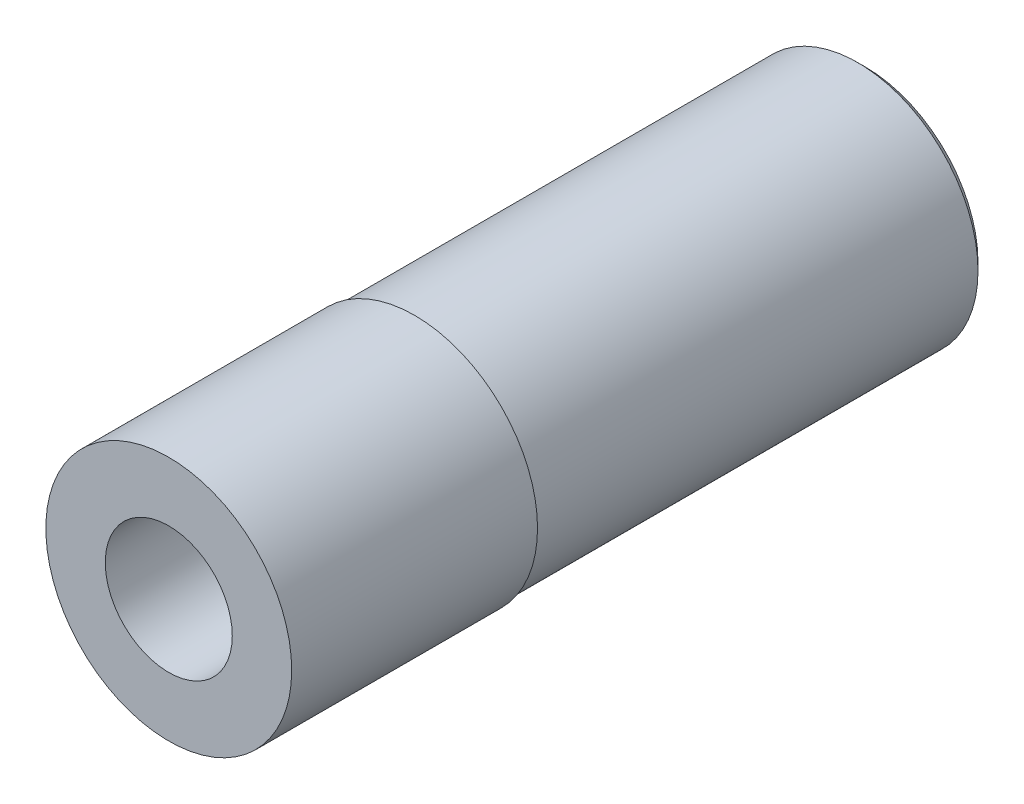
ISO-10303-21;
HEADER;
FILE_DESCRIPTION(('STEP AP214'),'2;1');
FILE_NAME('part.step','',(''),(''),'','','');
FILE_SCHEMA(('AUTOMOTIVE_DESIGN { 1 0 10303 214 1 1 1 1 }'));
ENDSEC;
DATA;
#1=APPLICATION_CONTEXT('core data for automotive mechanical design processes');
#2=APPLICATION_PROTOCOL_DEFINITION('international standard','automotive_design',2000,#1);
#3=PRODUCT_CONTEXT('',#1,'mechanical');
#4=PRODUCT('Part','Part','',(#3));
#5=PRODUCT_RELATED_PRODUCT_CATEGORY('part','',(#4));
#6=PRODUCT_DEFINITION_FORMATION('','',#4);
#7=PRODUCT_DEFINITION_CONTEXT('part definition',#1,'design');
#8=PRODUCT_DEFINITION('design','',#6,#7);
#9=PRODUCT_DEFINITION_SHAPE('','',#8);
#10=(LENGTH_UNIT() NAMED_UNIT(*) SI_UNIT(.MILLI.,.METRE.));
#11=(NAMED_UNIT(*) PLANE_ANGLE_UNIT() SI_UNIT($,.RADIAN.));
#12=(NAMED_UNIT(*) SI_UNIT($,.STERADIAN.) SOLID_ANGLE_UNIT());
#13=UNCERTAINTY_MEASURE_WITH_UNIT(LENGTH_MEASURE(1.E-05),#10,'distance_accuracy_value','');
#14=(GEOMETRIC_REPRESENTATION_CONTEXT(3) GLOBAL_UNCERTAINTY_ASSIGNED_CONTEXT((#13)) GLOBAL_UNIT_ASSIGNED_CONTEXT((#10,
#11,#12)) REPRESENTATION_CONTEXT('',''));
#15=CARTESIAN_POINT('',(0.,0.,0.));
#16=DIRECTION('',(0.,0.,1.));
#17=DIRECTION('',(1.,0.,0.));
#18=AXIS2_PLACEMENT_3D('',#15,#16,#17);
#19=CARTESIAN_POINT('',(0.,0.,3.79790950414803));
#20=DIRECTION('',(0.,0.,1.));
#21=DIRECTION('',(1.,0.,0.));
#22=AXIS2_PLACEMENT_3D('',#19,#20,#21);
#23=CYLINDRICAL_SURFACE('',#22,0.799999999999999);
#24=CARTESIAN_POINT('',(0.,0.,-14.));
#25=DIRECTION('',(0.,0.,1.));
#26=DIRECTION('',(1.,0.,0.));
#27=AXIS2_PLACEMENT_3D('',#24,#25,#26);
#28=CIRCLE('',#27,0.8);
#29=CARTESIAN_POINT('',(0.8,0.,-14.));
#30=VERTEX_POINT('',#29);
#31=EDGE_CURVE('E185',#30,#30,#28,.T.);
#32=ORIENTED_EDGE('',*,*,#31,.F.);
#33=EDGE_LOOP('',(#32));
#34=FACE_BOUND('',#33,.T.);
#35=CARTESIAN_POINT('',(0.,0.,-4.2));
#36=DIRECTION('',(0.,0.,1.));
#37=DIRECTION('',(1.,0.,0.));
#38=AXIS2_PLACEMENT_3D('',#35,#36,#37);
#39=CIRCLE('',#38,0.799999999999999);
#40=CARTESIAN_POINT('',(0.69282032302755,-0.399999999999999,-4.2));
#41=VERTEX_POINT('',#40);
#42=CARTESIAN_POINT('',(0.,-0.799999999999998,-4.2));
#43=VERTEX_POINT('',#42);
#44=EDGE_CURVE('E11',#41,#43,#39,.F.);
#45=ORIENTED_EDGE('',*,*,#44,.F.);
#46=CARTESIAN_POINT('',(0.69282032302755,0.399999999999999,-4.2));
#47=VERTEX_POINT('',#46);
#48=EDGE_CURVE('E38',#47,#41,#39,.F.);
#49=ORIENTED_EDGE('',*,*,#48,.F.);
#50=CARTESIAN_POINT('',(0.,0.799999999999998,-4.2));
#51=VERTEX_POINT('',#50);
#52=EDGE_CURVE('E111',#51,#47,#39,.F.);
#53=ORIENTED_EDGE('',*,*,#52,.F.);
#54=CARTESIAN_POINT('',(-0.69282032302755,0.399999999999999,-4.2));
#55=VERTEX_POINT('',#54);
#56=EDGE_CURVE('E296',#55,#51,#39,.F.);
#57=ORIENTED_EDGE('',*,*,#56,.F.);
#58=CARTESIAN_POINT('',(-0.692820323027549,-0.399999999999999,-4.2));
#59=VERTEX_POINT('',#58);
#60=EDGE_CURVE('E294',#59,#55,#39,.F.);
#61=ORIENTED_EDGE('',*,*,#60,.F.);
#62=EDGE_CURVE('E43',#43,#59,#39,.F.);
#63=ORIENTED_EDGE('',*,*,#62,.F.);
#64=EDGE_LOOP('',(#45,#49,#53,#57,#61,#63));
#65=FACE_BOUND('',#64,.T.);
#66=ADVANCED_FACE('F34',(#34,#65),#23,.F.);
#67=CARTESIAN_POINT('',(0.,0.,3.79790950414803));
#68=DIRECTION('',(0.,0.,1.));
#69=DIRECTION('',(1.,0.,0.));
#70=AXIS2_PLACEMENT_3D('',#67,#68,#69);
#71=CYLINDRICAL_SURFACE('',#70,3.);
#72=CARTESIAN_POINT('',(0.,0.,0.));
#73=DIRECTION('',(0.,0.,1.));
#74=DIRECTION('',(1.,0.,0.));
#75=AXIS2_PLACEMENT_3D('',#72,#73,#74);
#76=CIRCLE('',#75,3.);
#77=CARTESIAN_POINT('',(3.,0.,0.));
#78=VERTEX_POINT('',#77);
#79=EDGE_CURVE('E194',#78,#78,#76,.T.);
#80=ORIENTED_EDGE('',*,*,#79,.F.);
#81=EDGE_LOOP('',(#80));
#82=FACE_BOUND('',#81,.T.);
#83=CARTESIAN_POINT('',(0.,0.,-6.00000000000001));
#84=DIRECTION('',(0.,0.,-1.));
#85=DIRECTION('',(-1.,0.,0.));
#86=AXIS2_PLACEMENT_3D('',#83,#84,#85);
#87=CIRCLE('',#86,3.);
#88=CARTESIAN_POINT('',(-3.,0.,-6.00000000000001));
#89=VERTEX_POINT('',#88);
#90=EDGE_CURVE('E179',#89,#89,#87,.T.);
#91=ORIENTED_EDGE('',*,*,#90,.F.);
#92=EDGE_LOOP('',(#91));
#93=FACE_BOUND('',#92,.T.);
#94=ADVANCED_FACE('F36',(#82,#93),#71,.T.);
#95=CARTESIAN_POINT('',(0.,0.,-17.));
#96=DIRECTION('',(0.,0.,1.));
#97=DIRECTION('',(1.,0.,0.));
#98=AXIS2_PLACEMENT_3D('',#95,#96,#97);
#99=CONICAL_SURFACE('',#98,2.7499999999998,0.785398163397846);
#100=CARTESIAN_POINT('',(0.,0.,-17.));
#101=DIRECTION('',(0.,0.,1.));
#102=DIRECTION('',(1.,0.,0.));
#103=AXIS2_PLACEMENT_3D('',#100,#101,#102);
#104=CIRCLE('',#103,2.7499999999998);
#105=CARTESIAN_POINT('',(2.7499999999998,0.,-17.));
#106=VERTEX_POINT('',#105);
#107=EDGE_CURVE('E175',#106,#106,#104,.T.);
#108=ORIENTED_EDGE('',*,*,#107,.T.);
#109=EDGE_LOOP('',(#108));
#110=FACE_BOUND('',#109,.T.);
#111=CARTESIAN_POINT('',(0.,0.,-16.815));
#112=DIRECTION('',(0.,0.,1.));
#113=DIRECTION('',(1.,0.,0.));
#114=AXIS2_PLACEMENT_3D('',#111,#112,#113);
#115=CIRCLE('',#114,2.935);
#116=CARTESIAN_POINT('',(2.935,0.,-16.815));
#117=VERTEX_POINT('',#116);
#118=EDGE_CURVE('E174',#117,#117,#115,.T.);
#119=ORIENTED_EDGE('',*,*,#118,.F.);
#120=EDGE_LOOP('',(#119));
#121=FACE_BOUND('',#120,.T.);
#122=ADVANCED_FACE('F204',(#110,#121),#99,.T.);
#123=CARTESIAN_POINT('',(0.,3.,0.));
#124=DIRECTION('',(0.,0.,-1.));
#125=DIRECTION('',(-1.,0.,0.));
#126=AXIS2_PLACEMENT_3D('',#123,#124,#125);
#127=PLANE('',#126);
#128=CARTESIAN_POINT('',(0.,0.,0.));
#129=DIRECTION('',(0.,0.,1.));
#130=DIRECTION('',(1.,0.,0.));
#131=AXIS2_PLACEMENT_3D('',#128,#129,#130);
#132=CIRCLE('',#131,1.55);
#133=CARTESIAN_POINT('',(1.55,0.,0.));
#134=VERTEX_POINT('',#133);
#135=EDGE_CURVE('E191',#134,#134,#132,.T.);
#136=ORIENTED_EDGE('',*,*,#135,.F.);
#137=EDGE_LOOP('',(#136));
#138=FACE_BOUND('',#137,.T.);
#139=ORIENTED_EDGE('',*,*,#79,.T.);
#140=EDGE_LOOP('',(#139));
#141=FACE_BOUND('',#140,.T.);
#142=ADVANCED_FACE('F210',(#138,#141),#127,.F.);
#143=CARTESIAN_POINT('',(0.,0.,3.79790950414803));
#144=DIRECTION('',(0.,0.,1.));
#145=DIRECTION('',(1.,0.,0.));
#146=AXIS2_PLACEMENT_3D('',#143,#144,#145);
#147=CYLINDRICAL_SURFACE('',#146,1.55);
#148=CARTESIAN_POINT('',(0.,0.,-2.8));
#149=DIRECTION('',(0.,0.,1.));
#150=DIRECTION('',(1.,0.,0.));
#151=AXIS2_PLACEMENT_3D('',#148,#149,#150);
#152=CIRCLE('',#151,1.55);
#153=CARTESIAN_POINT('',(1.55,0.,-2.8));
#154=VERTEX_POINT('',#153);
#155=EDGE_CURVE('E188',#154,#154,#152,.T.);
#156=ORIENTED_EDGE('',*,*,#155,.F.);
#157=EDGE_LOOP('',(#156));
#158=FACE_BOUND('',#157,.T.);
#159=ORIENTED_EDGE('',*,*,#135,.T.);
#160=EDGE_LOOP('',(#159));
#161=FACE_BOUND('',#160,.T.);
#162=ADVANCED_FACE('F218',(#158,#161),#147,.F.);
#163=CARTESIAN_POINT('',(0.,1.55,-2.8));
#164=DIRECTION('',(0.,0.,-1.));
#165=DIRECTION('',(-1.,0.,0.));
#166=AXIS2_PLACEMENT_3D('',#163,#164,#165);
#167=PLANE('',#166);
#168=DIRECTION('',(-1.,0.,0.));
#169=VECTOR('',#168,1.);
#170=CARTESIAN_POINT('',(0.4618802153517,0.799999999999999,-2.8));
#171=LINE('',#170,#169);
#172=CARTESIAN_POINT('',(0.4618802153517,0.799999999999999,-2.8));
#173=VERTEX_POINT('',#172);
#174=CARTESIAN_POINT('',(-0.4618802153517,0.799999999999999,-2.8));
#175=VERTEX_POINT('',#174);
#176=EDGE_CURVE('E50',#173,#175,#171,.T.);
#177=ORIENTED_EDGE('',*,*,#176,.F.);
#178=DIRECTION('',(-0.5,0.866025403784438,0.));
#179=VECTOR('',#178,1.);
#180=CARTESIAN_POINT('',(0.9237604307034,0.,-2.8));
#181=LINE('',#180,#179);
#182=CARTESIAN_POINT('',(0.9237604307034,0.,-2.8));
#183=VERTEX_POINT('',#182);
#184=EDGE_CURVE('E120',#183,#173,#181,.T.);
#185=ORIENTED_EDGE('',*,*,#184,.F.);
#186=DIRECTION('',(0.5,0.866025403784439,0.));
#187=VECTOR('',#186,1.);
#188=CARTESIAN_POINT('',(0.4618802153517,-0.799999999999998,-2.8));
#189=LINE('',#188,#187);
#190=CARTESIAN_POINT('',(0.4618802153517,-0.799999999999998,-2.8));
#191=VERTEX_POINT('',#190);
#192=EDGE_CURVE('E114',#191,#183,#189,.T.);
#193=ORIENTED_EDGE('',*,*,#192,.F.);
#194=DIRECTION('',(1.,0.,0.));
#195=VECTOR('',#194,1.);
#196=CARTESIAN_POINT('',(-0.461880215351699,-0.799999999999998,-2.8));
#197=LINE('',#196,#195);
#198=CARTESIAN_POINT('',(-0.461880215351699,-0.799999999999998,-2.8));
#199=VERTEX_POINT('',#198);
#200=EDGE_CURVE('E154',#199,#191,#197,.T.);
#201=ORIENTED_EDGE('',*,*,#200,.F.);
#202=DIRECTION('',(0.5,-0.866025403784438,0.));
#203=VECTOR('',#202,1.);
#204=CARTESIAN_POINT('',(-0.923760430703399,0.,-2.8));
#205=LINE('',#204,#203);
#206=CARTESIAN_POINT('',(-0.923760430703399,0.,-2.8));
#207=VERTEX_POINT('',#206);
#208=EDGE_CURVE('E151',#207,#199,#205,.T.);
#209=ORIENTED_EDGE('',*,*,#208,.F.);
#210=DIRECTION('',(-0.5,-0.866025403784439,0.));
#211=VECTOR('',#210,1.);
#212=CARTESIAN_POINT('',(-0.4618802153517,0.799999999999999,-2.8));
#213=LINE('',#212,#211);
#214=EDGE_CURVE('E148',#175,#207,#213,.T.);
#215=ORIENTED_EDGE('',*,*,#214,.F.);
#216=EDGE_LOOP('',(#177,#185,#193,#201,#209,#215));
#217=FACE_BOUND('',#216,.T.);
#218=ORIENTED_EDGE('',*,*,#155,.T.);
#219=EDGE_LOOP('',(#218));
#220=FACE_BOUND('',#219,.T.);
#221=ADVANCED_FACE('F223',(#217,#220),#167,.F.);
#222=CARTESIAN_POINT('',(0.,0.8,-14.));
#223=DIRECTION('',(0.,0.,1.));
#224=DIRECTION('',(1.,0.,0.));
#225=AXIS2_PLACEMENT_3D('',#222,#223,#224);
#226=PLANE('',#225);
#227=CARTESIAN_POINT('',(0.,0.,-14.));
#228=DIRECTION('',(0.,0.,1.));
#229=DIRECTION('',(1.,0.,0.));
#230=AXIS2_PLACEMENT_3D('',#227,#228,#229);
#231=CIRCLE('',#230,1.5);
#232=CARTESIAN_POINT('',(1.5,0.,-14.));
#233=VERTEX_POINT('',#232);
#234=EDGE_CURVE('E182',#233,#233,#231,.T.);
#235=ORIENTED_EDGE('',*,*,#234,.F.);
#236=EDGE_LOOP('',(#235));
#237=FACE_BOUND('',#236,.T.);
#238=ORIENTED_EDGE('',*,*,#31,.T.);
#239=EDGE_LOOP('',(#238));
#240=FACE_BOUND('',#239,.T.);
#241=ADVANCED_FACE('F229',(#237,#240),#226,.F.);
#242=CARTESIAN_POINT('',(0.,0.,3.79790950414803));
#243=DIRECTION('',(0.,0.,1.));
#244=DIRECTION('',(1.,0.,0.));
#245=AXIS2_PLACEMENT_3D('',#242,#243,#244);
#246=CYLINDRICAL_SURFACE('',#245,1.5);
#247=CARTESIAN_POINT('',(0.,0.,-17.));
#248=DIRECTION('',(0.,0.,1.));
#249=DIRECTION('',(1.,0.,0.));
#250=AXIS2_PLACEMENT_3D('',#247,#248,#249);
#251=CIRCLE('',#250,1.5);
#252=CARTESIAN_POINT('',(1.5,0.,-17.));
#253=VERTEX_POINT('',#252);
#254=EDGE_CURVE('E178',#253,#253,#251,.T.);
#255=ORIENTED_EDGE('',*,*,#254,.F.);
#256=EDGE_LOOP('',(#255));
#257=FACE_BOUND('',#256,.T.);
#258=ORIENTED_EDGE('',*,*,#234,.T.);
#259=EDGE_LOOP('',(#258));
#260=FACE_BOUND('',#259,.T.);
#261=ADVANCED_FACE('F233',(#257,#260),#246,.F.);
#262=CARTESIAN_POINT('',(0.,1.5,-17.));
#263=DIRECTION('',(0.,0.,1.));
#264=DIRECTION('',(1.,0.,0.));
#265=AXIS2_PLACEMENT_3D('',#262,#263,#264);
#266=PLANE('',#265);
#267=ORIENTED_EDGE('',*,*,#107,.F.);
#268=EDGE_LOOP('',(#267));
#269=FACE_BOUND('',#268,.T.);
#270=ORIENTED_EDGE('',*,*,#254,.T.);
#271=EDGE_LOOP('',(#270));
#272=FACE_BOUND('',#271,.T.);
#273=ADVANCED_FACE('F237',(#269,#272),#266,.F.);
#274=CARTESIAN_POINT('',(0.,3.935,-6.00000000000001));
#275=DIRECTION('',(0.,0.,-1.));
#276=DIRECTION('',(-1.,0.,0.));
#277=AXIS2_PLACEMENT_3D('',#274,#275,#276);
#278=PLANE('',#277);
#279=CARTESIAN_POINT('',(0.,0.,-6.00000000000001));
#280=DIRECTION('',(0.,0.,1.));
#281=DIRECTION('',(1.,0.,0.));
#282=AXIS2_PLACEMENT_3D('',#279,#280,#281);
#283=CIRCLE('',#282,2.935);
#284=CARTESIAN_POINT('',(2.935,0.,-6.00000000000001));
#285=VERTEX_POINT('',#284);
#286=EDGE_CURVE('E160',#285,#285,#283,.T.);
#287=ORIENTED_EDGE('',*,*,#286,.T.);
#288=EDGE_LOOP('',(#287));
#289=FACE_BOUND('',#288,.T.);
#290=ORIENTED_EDGE('',*,*,#90,.T.);
#291=EDGE_LOOP('',(#290));
#292=FACE_BOUND('',#291,.T.);
#293=ADVANCED_FACE('F201',(#289,#292),#278,.T.);
#294=CARTESIAN_POINT('',(0.,0.,0.));
#295=DIRECTION('',(0.,0.,1.));
#296=DIRECTION('',(1.,0.,0.));
#297=AXIS2_PLACEMENT_3D('',#294,#295,#296);
#298=CYLINDRICAL_SURFACE('',#297,2.935);
#299=ORIENTED_EDGE('',*,*,#286,.F.);
#300=EDGE_LOOP('',(#299));
#301=FACE_BOUND('',#300,.T.);
#302=ORIENTED_EDGE('',*,*,#118,.T.);
#303=EDGE_LOOP('',(#302));
#304=FACE_BOUND('',#303,.T.);
#305=ADVANCED_FACE('F244',(#301,#304),#298,.T.);
#306=CARTESIAN_POINT('',(0.9237604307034,0.,-4.2));
#307=DIRECTION('',(0.866025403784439,0.5,0.));
#308=DIRECTION('',(-0.5,0.866025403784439,0.));
#309=AXIS2_PLACEMENT_3D('',#306,#307,#308);
#310=PLANE('',#309);
#311=ORIENTED_EDGE('',*,*,#184,.T.);
#312=DIRECTION('',(0.,0.,1.));
#313=VECTOR('',#312,1.);
#314=CARTESIAN_POINT('',(0.4618802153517,0.799999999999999,-4.2));
#315=LINE('',#314,#313);
#316=CARTESIAN_POINT('',(0.4618802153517,0.799999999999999,-4.2));
#317=VERTEX_POINT('',#316);
#318=EDGE_CURVE('E117',#317,#173,#315,.T.);
#319=ORIENTED_EDGE('',*,*,#318,.F.);
#320=DIRECTION('',(-0.5,0.866025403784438,0.));
#321=VECTOR('',#320,1.);
#322=CARTESIAN_POINT('',(0.9237604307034,0.,-4.2));
#323=LINE('',#322,#321);
#324=EDGE_CURVE('E105',#47,#317,#323,.T.);
#325=ORIENTED_EDGE('',*,*,#324,.F.);
#326=CARTESIAN_POINT('',(0.9237604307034,0.,-4.2));
#327=VERTEX_POINT('',#326);
#328=EDGE_CURVE('E58',#327,#47,#323,.T.);
#329=ORIENTED_EDGE('',*,*,#328,.F.);
#330=DIRECTION('',(0.,0.,1.));
#331=VECTOR('',#330,1.);
#332=CARTESIAN_POINT('',(0.9237604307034,0.,-4.2));
#333=LINE('',#332,#331);
#334=EDGE_CURVE('E158',#327,#183,#333,.T.);
#335=ORIENTED_EDGE('',*,*,#334,.T.);
#336=EDGE_LOOP('',(#311,#319,#325,#329,#335));
#337=FACE_BOUND('',#336,.T.);
#338=ADVANCED_FACE('F118',(#337),#310,.F.);
#339=CARTESIAN_POINT('',(0.4618802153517,-0.799999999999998,-4.2));
#340=DIRECTION('',(0.866025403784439,-0.5,0.));
#341=DIRECTION('',(0.5,0.866025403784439,0.));
#342=AXIS2_PLACEMENT_3D('',#339,#340,#341);
#343=PLANE('',#342);
#344=ORIENTED_EDGE('',*,*,#192,.T.);
#345=ORIENTED_EDGE('',*,*,#334,.F.);
#346=DIRECTION('',(0.5,0.866025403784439,0.));
#347=VECTOR('',#346,1.);
#348=CARTESIAN_POINT('',(0.4618802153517,-0.799999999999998,-4.2));
#349=LINE('',#348,#347);
#350=EDGE_CURVE('E143',#41,#327,#349,.T.);
#351=ORIENTED_EDGE('',*,*,#350,.F.);
#352=CARTESIAN_POINT('',(0.4618802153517,-0.799999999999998,-4.2));
#353=VERTEX_POINT('',#352);
#354=EDGE_CURVE('E123',#353,#41,#349,.T.);
#355=ORIENTED_EDGE('',*,*,#354,.F.);
#356=DIRECTION('',(0.,0.,1.));
#357=VECTOR('',#356,1.);
#358=CARTESIAN_POINT('',(0.4618802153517,-0.799999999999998,-4.2));
#359=LINE('',#358,#357);
#360=EDGE_CURVE('E161',#353,#191,#359,.T.);
#361=ORIENTED_EDGE('',*,*,#360,.T.);
#362=EDGE_LOOP('',(#344,#345,#351,#355,#361));
#363=FACE_BOUND('',#362,.T.);
#364=ADVANCED_FACE('F251',(#363),#343,.F.);
#365=CARTESIAN_POINT('',(-0.461880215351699,-0.799999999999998,-4.2));
#366=DIRECTION('',(0.,-1.,0.));
#367=DIRECTION('',(0.,0.,-1.));
#368=AXIS2_PLACEMENT_3D('',#365,#366,#367);
#369=PLANE('',#368);
#370=ORIENTED_EDGE('',*,*,#200,.T.);
#371=ORIENTED_EDGE('',*,*,#360,.F.);
#372=DIRECTION('',(1.,0.,0.));
#373=VECTOR('',#372,1.);
#374=CARTESIAN_POINT('',(-0.461880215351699,-0.799999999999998,-4.2));
#375=LINE('',#374,#373);
#376=EDGE_CURVE('E139',#43,#353,#375,.T.);
#377=ORIENTED_EDGE('',*,*,#376,.F.);
#378=CARTESIAN_POINT('',(-0.461880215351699,-0.799999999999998,-4.2));
#379=VERTEX_POINT('',#378);
#380=EDGE_CURVE('E140',#379,#43,#375,.T.);
#381=ORIENTED_EDGE('',*,*,#380,.F.);
#382=DIRECTION('',(0.,0.,1.));
#383=VECTOR('',#382,1.);
#384=CARTESIAN_POINT('',(-0.461880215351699,-0.799999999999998,-4.2));
#385=LINE('',#384,#383);
#386=EDGE_CURVE('E164',#379,#199,#385,.T.);
#387=ORIENTED_EDGE('',*,*,#386,.T.);
#388=EDGE_LOOP('',(#370,#371,#377,#381,#387));
#389=FACE_BOUND('',#388,.T.);
#390=ADVANCED_FACE('F262',(#389),#369,.F.);
#391=CARTESIAN_POINT('',(-0.923760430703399,0.,-4.2));
#392=DIRECTION('',(-0.866025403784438,-0.5,0.));
#393=DIRECTION('',(0.5,-0.866025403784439,0.));
#394=AXIS2_PLACEMENT_3D('',#391,#392,#393);
#395=PLANE('',#394);
#396=ORIENTED_EDGE('',*,*,#208,.T.);
#397=ORIENTED_EDGE('',*,*,#386,.F.);
#398=DIRECTION('',(0.5,-0.866025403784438,0.));
#399=VECTOR('',#398,1.);
#400=CARTESIAN_POINT('',(-0.923760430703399,0.,-4.2));
#401=LINE('',#400,#399);
#402=EDGE_CURVE('E135',#59,#379,#401,.T.);
#403=ORIENTED_EDGE('',*,*,#402,.F.);
#404=CARTESIAN_POINT('',(-0.923760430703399,0.,-4.2));
#405=VERTEX_POINT('',#404);
#406=EDGE_CURVE('E136',#405,#59,#401,.T.);
#407=ORIENTED_EDGE('',*,*,#406,.F.);
#408=DIRECTION('',(0.,0.,1.));
#409=VECTOR('',#408,1.);
#410=CARTESIAN_POINT('',(-0.923760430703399,0.,-4.2));
#411=LINE('',#410,#409);
#412=EDGE_CURVE('E167',#405,#207,#411,.T.);
#413=ORIENTED_EDGE('',*,*,#412,.T.);
#414=EDGE_LOOP('',(#396,#397,#403,#407,#413));
#415=FACE_BOUND('',#414,.T.);
#416=ADVANCED_FACE('F258',(#415),#395,.F.);
#417=CARTESIAN_POINT('',(-0.4618802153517,0.799999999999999,-4.2));
#418=DIRECTION('',(-0.866025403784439,0.5,0.));
#419=DIRECTION('',(-0.5,-0.866025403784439,0.));
#420=AXIS2_PLACEMENT_3D('',#417,#418,#419);
#421=PLANE('',#420);
#422=ORIENTED_EDGE('',*,*,#214,.T.);
#423=ORIENTED_EDGE('',*,*,#412,.F.);
#424=DIRECTION('',(-0.5,-0.866025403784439,0.));
#425=VECTOR('',#424,1.);
#426=CARTESIAN_POINT('',(-0.4618802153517,0.799999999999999,-4.2));
#427=LINE('',#426,#425);
#428=EDGE_CURVE('E129',#55,#405,#427,.T.);
#429=ORIENTED_EDGE('',*,*,#428,.F.);
#430=CARTESIAN_POINT('',(-0.4618802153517,0.799999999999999,-4.2));
#431=VERTEX_POINT('',#430);
#432=EDGE_CURVE('E131',#431,#55,#427,.T.);
#433=ORIENTED_EDGE('',*,*,#432,.F.);
#434=DIRECTION('',(0.,0.,1.));
#435=VECTOR('',#434,1.);
#436=CARTESIAN_POINT('',(-0.4618802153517,0.799999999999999,-4.2));
#437=LINE('',#436,#435);
#438=EDGE_CURVE('E122',#431,#175,#437,.T.);
#439=ORIENTED_EDGE('',*,*,#438,.T.);
#440=EDGE_LOOP('',(#422,#423,#429,#433,#439));
#441=FACE_BOUND('',#440,.T.);
#442=ADVANCED_FACE('F255',(#441),#421,.F.);
#443=CARTESIAN_POINT('',(0.4618802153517,0.799999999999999,-4.2));
#444=DIRECTION('',(0.,1.,0.));
#445=DIRECTION('',(-1.,0.,0.));
#446=AXIS2_PLACEMENT_3D('',#443,#444,#445);
#447=PLANE('',#446);
#448=ORIENTED_EDGE('',*,*,#176,.T.);
#449=ORIENTED_EDGE('',*,*,#438,.F.);
#450=DIRECTION('',(-1.,0.,0.));
#451=VECTOR('',#450,1.);
#452=CARTESIAN_POINT('',(0.4618802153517,0.799999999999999,-4.2));
#453=LINE('',#452,#451);
#454=EDGE_CURVE('E128',#51,#431,#453,.T.);
#455=ORIENTED_EDGE('',*,*,#454,.F.);
#456=EDGE_CURVE('E109',#317,#51,#453,.T.);
#457=ORIENTED_EDGE('',*,*,#456,.F.);
#458=ORIENTED_EDGE('',*,*,#318,.T.);
#459=EDGE_LOOP('',(#448,#449,#455,#457,#458));
#460=FACE_BOUND('',#459,.T.);
#461=ADVANCED_FACE('F126',(#460),#447,.F.);
#462=CARTESIAN_POINT('',(0.4618802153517,0.799999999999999,-4.2));
#463=DIRECTION('',(0.,0.,1.));
#464=DIRECTION('',(1.,0.,0.));
#465=AXIS2_PLACEMENT_3D('',#462,#463,#464);
#466=PLANE('',#465);
#467=ORIENTED_EDGE('',*,*,#44,.T.);
#468=ORIENTED_EDGE('',*,*,#376,.T.);
#469=ORIENTED_EDGE('',*,*,#354,.T.);
#470=EDGE_LOOP('',(#467,#468,#469));
#471=FACE_BOUND('',#470,.T.);
#472=ADVANCED_FACE('F254',(#471),#466,.T.);
#473=ORIENTED_EDGE('',*,*,#62,.T.);
#474=ORIENTED_EDGE('',*,*,#402,.T.);
#475=ORIENTED_EDGE('',*,*,#380,.T.);
#476=EDGE_LOOP('',(#473,#474,#475));
#477=FACE_BOUND('',#476,.T.);
#478=ADVANCED_FACE('F271',(#477),#466,.T.);
#479=ORIENTED_EDGE('',*,*,#60,.T.);
#480=ORIENTED_EDGE('',*,*,#428,.T.);
#481=ORIENTED_EDGE('',*,*,#406,.T.);
#482=EDGE_LOOP('',(#479,#480,#481));
#483=FACE_BOUND('',#482,.T.);
#484=ADVANCED_FACE('F277',(#483),#466,.T.);
#485=ORIENTED_EDGE('',*,*,#56,.T.);
#486=ORIENTED_EDGE('',*,*,#454,.T.);
#487=ORIENTED_EDGE('',*,*,#432,.T.);
#488=EDGE_LOOP('',(#485,#486,#487));
#489=FACE_BOUND('',#488,.T.);
#490=ADVANCED_FACE('F283',(#489),#466,.T.);
#491=ORIENTED_EDGE('',*,*,#52,.T.);
#492=ORIENTED_EDGE('',*,*,#324,.T.);
#493=ORIENTED_EDGE('',*,*,#456,.T.);
#494=EDGE_LOOP('',(#491,#492,#493));
#495=FACE_BOUND('',#494,.T.);
#496=ADVANCED_FACE('F107',(#495),#466,.T.);
#497=ORIENTED_EDGE('',*,*,#48,.T.);
#498=ORIENTED_EDGE('',*,*,#350,.T.);
#499=ORIENTED_EDGE('',*,*,#328,.T.);
#500=EDGE_LOOP('',(#497,#498,#499));
#501=FACE_BOUND('',#500,.T.);
#502=ADVANCED_FACE('F273',(#501),#466,.T.);
#503=CLOSED_SHELL('',(#66,#94,#122,#142,#162,#221,#241,#261,#273,#293,#305,#338,#364,#390,#416,
#442,#461,#472,#478,#484,#490,#496,#502));
#504=MANIFOLD_SOLID_BREP('B2',#503);
#505=ADVANCED_BREP_SHAPE_REPRESENTATION('',(#18,#504),#14);
#506=SHAPE_DEFINITION_REPRESENTATION(#9,#505);
ENDSEC;
END-ISO-10303-21;
